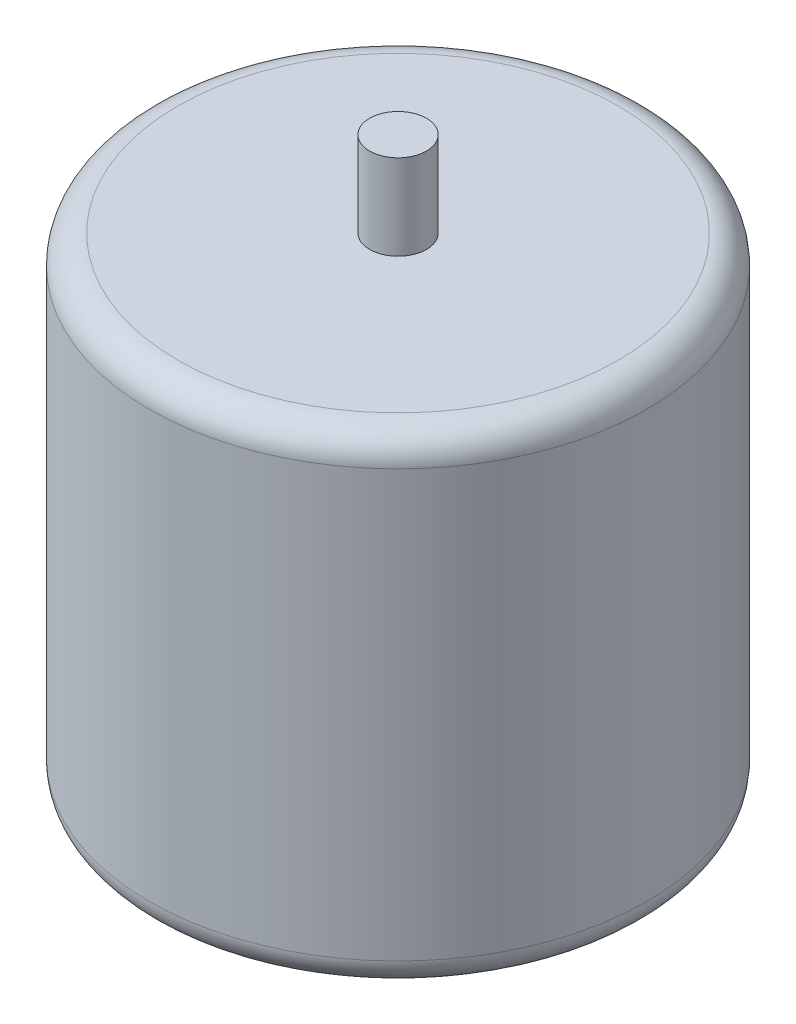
from build123d import *

# Parameters (mm, degrees)
SKETCH_1_R      = 17.5
EXTRUDE_1_DEPTH = 34
FILLET_1_R      = 2
SKETCH_2_R      = 2
EXTRUDE_2_DEPTH = 6


with BuildPart() as part:
    # Sketch 1 → Extrude 1 (new body)
    with BuildSketch(Plane(origin=(0, 0, 0), x_dir=(1, 0, 0), z_dir=(0, 1, 0))):
        with Locations(Location((0, 0, 0), (0, 0, 270))):
            Circle(SKETCH_1_R)
    extrude(amount=EXTRUDE_1_DEPTH)

    # Fillet 1
    fillet_1_edges = [part.edges().sort_by_distance(p)[0] for p in [
        (0, 0, -17.5),
        (0, 34, -17.5),
    ]]
    fillet(fillet_1_edges, radius=FILLET_1_R)

    # Sketch 2 → Extrude 2 (add)
    with BuildSketch(Plane(origin=(0, 34, 0), x_dir=(1, 0, 0), z_dir=(0, 1, 0))):
        with Locations(Location((0, 0, 0), (0, 0, 270))):
            Circle(SKETCH_2_R)
    extrude(amount=EXTRUDE_2_DEPTH)


solid = part.part
